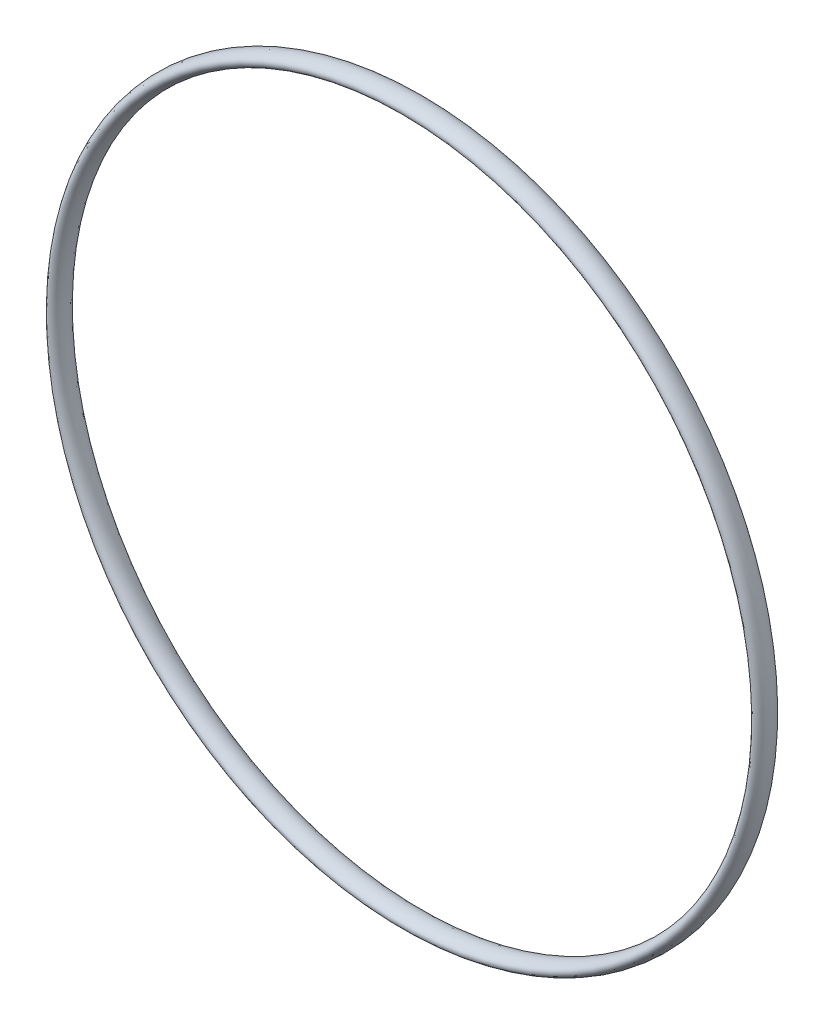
from build123d import *

# Parameters (mm, degrees)
ESQUISSE1_RX = 2.4
ESQUISSE1_RY = 1.45


with BuildPart() as part:
    # Esquisse1 → Base-R_volution (revolve)
    with BuildSketch(Plane(origin=(0, 0, 0), x_dir=(0, 0, -1), z_dir=(1, 0, 0))):
        with Locations((2.4, 75.95)):
            Ellipse(ESQUISSE1_RX, ESQUISSE1_RY)
    revolve(axis=Axis((0, 0, 0), (0, 0, -1)))


solid = part.part
